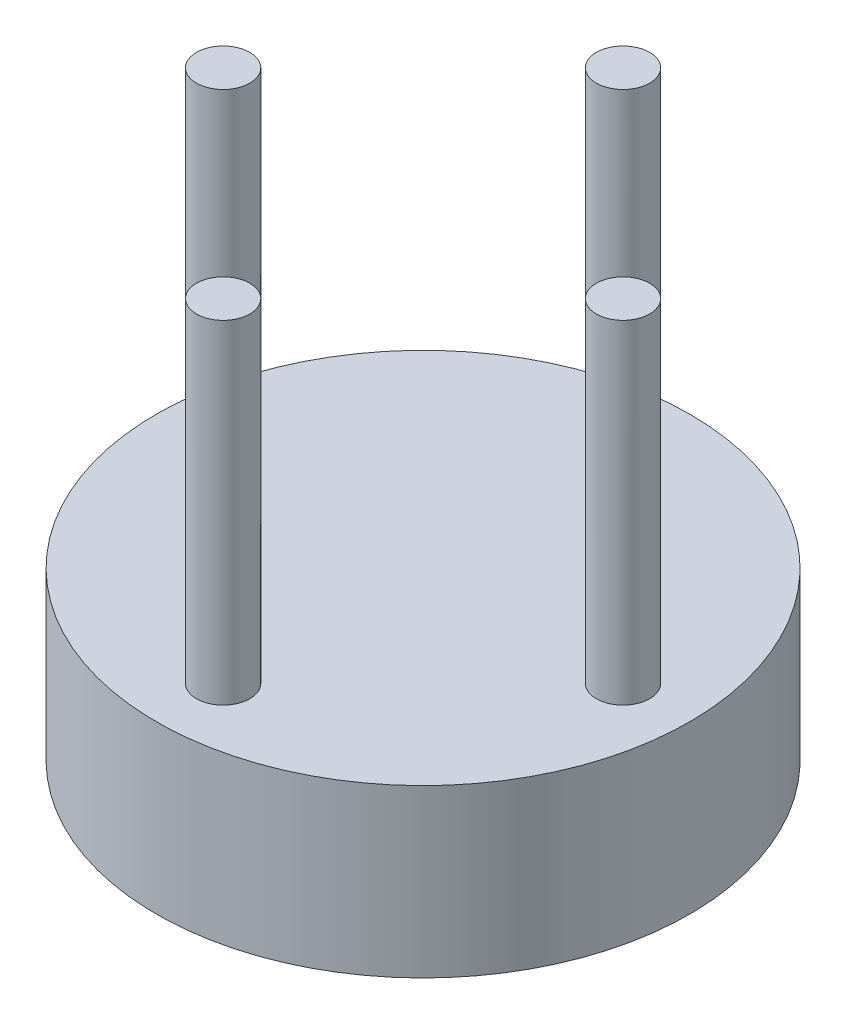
ISO-10303-21;
HEADER;
FILE_DESCRIPTION(('STEP AP214'),'2;1');
FILE_NAME('part.step','',(''),(''),'','','');
FILE_SCHEMA(('AUTOMOTIVE_DESIGN { 1 0 10303 214 1 1 1 1 }'));
ENDSEC;
DATA;
#1=APPLICATION_CONTEXT('core data for automotive mechanical design processes');
#2=APPLICATION_PROTOCOL_DEFINITION('international standard','automotive_design',2000,#1);
#3=PRODUCT_CONTEXT('',#1,'mechanical');
#4=PRODUCT('Part','Part','',(#3));
#5=PRODUCT_RELATED_PRODUCT_CATEGORY('part','',(#4));
#6=PRODUCT_DEFINITION_FORMATION('','',#4);
#7=PRODUCT_DEFINITION_CONTEXT('part definition',#1,'design');
#8=PRODUCT_DEFINITION('design','',#6,#7);
#9=PRODUCT_DEFINITION_SHAPE('','',#8);
#10=(LENGTH_UNIT() NAMED_UNIT(*) SI_UNIT(.MILLI.,.METRE.));
#11=(NAMED_UNIT(*) PLANE_ANGLE_UNIT() SI_UNIT($,.RADIAN.));
#12=(NAMED_UNIT(*) SI_UNIT($,.STERADIAN.) SOLID_ANGLE_UNIT());
#13=UNCERTAINTY_MEASURE_WITH_UNIT(LENGTH_MEASURE(1.E-05),#10,'distance_accuracy_value','');
#14=(GEOMETRIC_REPRESENTATION_CONTEXT(3) GLOBAL_UNCERTAINTY_ASSIGNED_CONTEXT((#13)) GLOBAL_UNIT_ASSIGNED_CONTEXT((#10,
#11,#12)) REPRESENTATION_CONTEXT('',''));
#15=CARTESIAN_POINT('',(0.,0.,0.));
#16=DIRECTION('',(0.,0.,1.));
#17=DIRECTION('',(1.,0.,0.));
#18=AXIS2_PLACEMENT_3D('',#15,#16,#17);
#19=CARTESIAN_POINT('',(-40.,30.,0.));
#20=DIRECTION('',(0.,-1.,0.));
#21=DIRECTION('',(0.,0.,-1.));
#22=AXIS2_PLACEMENT_3D('',#19,#20,#21);
#23=PLANE('',#22);
#24=CARTESIAN_POINT('',(-30.,30.,2.09489001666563E-13));
#25=DIRECTION('',(0.,-1.,0.));
#26=DIRECTION('',(0.,0.,-1.));
#27=AXIS2_PLACEMENT_3D('',#24,#25,#26);
#28=CIRCLE('',#27,4.);
#29=CARTESIAN_POINT('',(-30.,30.,-3.99999999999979));
#30=VERTEX_POINT('',#29);
#31=EDGE_CURVE('E29',#30,#30,#28,.F.);
#32=ORIENTED_EDGE('',*,*,#31,.F.);
#33=EDGE_LOOP('',(#32));
#34=FACE_BOUND('',#33,.T.);
#35=CARTESIAN_POINT('',(30.,30.,0.));
#36=DIRECTION('',(0.,-1.,0.));
#37=DIRECTION('',(0.,0.,-1.));
#38=AXIS2_PLACEMENT_3D('',#35,#36,#37);
#39=CIRCLE('',#38,4.);
#40=CARTESIAN_POINT('',(30.,30.,-4.));
#41=VERTEX_POINT('',#40);
#42=EDGE_CURVE('E37',#41,#41,#39,.F.);
#43=ORIENTED_EDGE('',*,*,#42,.F.);
#44=EDGE_LOOP('',(#43));
#45=FACE_BOUND('',#44,.T.);
#46=CARTESIAN_POINT('',(0.,30.,0.));
#47=DIRECTION('',(0.,-1.,0.));
#48=DIRECTION('',(0.,0.,-1.));
#49=AXIS2_PLACEMENT_3D('',#46,#47,#48);
#50=CIRCLE('',#49,40.);
#51=CARTESIAN_POINT('',(0.,30.,-40.));
#52=VERTEX_POINT('',#51);
#53=EDGE_CURVE('E57',#52,#52,#50,.T.);
#54=ORIENTED_EDGE('',*,*,#53,.F.);
#55=EDGE_LOOP('',(#54));
#56=FACE_BOUND('',#55,.T.);
#57=CARTESIAN_POINT('',(-1.04744500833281E-13,30.,-30.));
#58=DIRECTION('',(0.,-1.,0.));
#59=DIRECTION('',(0.,0.,-1.));
#60=AXIS2_PLACEMENT_3D('',#57,#58,#59);
#61=CIRCLE('',#60,4.);
#62=CARTESIAN_POINT('',(-1.04744500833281E-13,30.,-34.));
#63=VERTEX_POINT('',#62);
#64=EDGE_CURVE('E33',#63,#63,#61,.F.);
#65=ORIENTED_EDGE('',*,*,#64,.F.);
#66=EDGE_LOOP('',(#65));
#67=FACE_BOUND('',#66,.T.);
#68=CARTESIAN_POINT('',(3.14233502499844E-13,30.,30.));
#69=DIRECTION('',(0.,-1.,0.));
#70=DIRECTION('',(0.,0.,-1.));
#71=AXIS2_PLACEMENT_3D('',#68,#69,#70);
#72=CIRCLE('',#71,4.);
#73=CARTESIAN_POINT('',(3.14233502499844E-13,30.,26.));
#74=VERTEX_POINT('',#73);
#75=EDGE_CURVE('E10',#74,#74,#72,.F.);
#76=ORIENTED_EDGE('',*,*,#75,.F.);
#77=EDGE_LOOP('',(#76));
#78=FACE_BOUND('',#77,.T.);
#79=ADVANCED_FACE('F22',(#34,#45,#56,#67,#78),#23,.F.);
#80=CARTESIAN_POINT('',(0.,5.,0.));
#81=DIRECTION('',(0.,1.,0.));
#82=DIRECTION('',(0.,0.,1.));
#83=AXIS2_PLACEMENT_3D('',#80,#81,#82);
#84=PLANE('',#83);
#85=CARTESIAN_POINT('',(0.,5.,0.));
#86=DIRECTION('',(0.,-1.,0.));
#87=DIRECTION('',(0.,0.,-1.));
#88=AXIS2_PLACEMENT_3D('',#85,#86,#87);
#89=CIRCLE('',#88,27.5);
#90=CARTESIAN_POINT('',(0.,5.,-27.5));
#91=VERTEX_POINT('',#90);
#92=EDGE_CURVE('E42',#91,#91,#89,.T.);
#93=ORIENTED_EDGE('',*,*,#92,.T.);
#94=EDGE_LOOP('',(#93));
#95=FACE_BOUND('',#94,.T.);
#96=ADVANCED_FACE('F24',(#95),#84,.F.);
#97=CARTESIAN_POINT('',(0.,0.,0.));
#98=DIRECTION('',(0.,-1.,0.));
#99=DIRECTION('',(0.,0.,-1.));
#100=AXIS2_PLACEMENT_3D('',#97,#98,#99);
#101=CYLINDRICAL_SURFACE('',#100,27.5);
#102=ORIENTED_EDGE('',*,*,#92,.F.);
#103=EDGE_LOOP('',(#102));
#104=FACE_BOUND('',#103,.T.);
#105=CARTESIAN_POINT('',(0.,0.,0.));
#106=DIRECTION('',(0.,-1.,0.));
#107=DIRECTION('',(0.,0.,-1.));
#108=AXIS2_PLACEMENT_3D('',#105,#106,#107);
#109=CIRCLE('',#108,27.5);
#110=CARTESIAN_POINT('',(0.,0.,-27.5));
#111=VERTEX_POINT('',#110);
#112=EDGE_CURVE('E45',#111,#111,#109,.T.);
#113=ORIENTED_EDGE('',*,*,#112,.T.);
#114=EDGE_LOOP('',(#113));
#115=FACE_BOUND('',#114,.T.);
#116=ADVANCED_FACE('F93',(#104,#115),#101,.F.);
#117=CARTESIAN_POINT('',(-27.5,0.,0.));
#118=DIRECTION('',(0.,1.,0.));
#119=DIRECTION('',(0.,0.,1.));
#120=AXIS2_PLACEMENT_3D('',#117,#118,#119);
#121=PLANE('',#120);
#122=ORIENTED_EDGE('',*,*,#112,.F.);
#123=EDGE_LOOP('',(#122));
#124=FACE_BOUND('',#123,.T.);
#125=CARTESIAN_POINT('',(0.,0.,0.));
#126=DIRECTION('',(0.,-1.,0.));
#127=DIRECTION('',(0.,0.,-1.));
#128=AXIS2_PLACEMENT_3D('',#125,#126,#127);
#129=CIRCLE('',#128,32.5);
#130=CARTESIAN_POINT('',(0.,0.,-32.5));
#131=VERTEX_POINT('',#130);
#132=EDGE_CURVE('E48',#131,#131,#129,.T.);
#133=ORIENTED_EDGE('',*,*,#132,.T.);
#134=EDGE_LOOP('',(#133));
#135=FACE_BOUND('',#134,.T.);
#136=ADVANCED_FACE('F111',(#124,#135),#121,.F.);
#137=CARTESIAN_POINT('',(0.,0.,0.));
#138=DIRECTION('',(0.,-1.,0.));
#139=DIRECTION('',(0.,0.,-1.));
#140=AXIS2_PLACEMENT_3D('',#137,#138,#139);
#141=CYLINDRICAL_SURFACE('',#140,32.5);
#142=ORIENTED_EDGE('',*,*,#132,.F.);
#143=EDGE_LOOP('',(#142));
#144=FACE_BOUND('',#143,.T.);
#145=CARTESIAN_POINT('',(0.,5.,0.));
#146=DIRECTION('',(0.,-1.,0.));
#147=DIRECTION('',(0.,0.,-1.));
#148=AXIS2_PLACEMENT_3D('',#145,#146,#147);
#149=CIRCLE('',#148,32.5);
#150=CARTESIAN_POINT('',(0.,5.,-32.5));
#151=VERTEX_POINT('',#150);
#152=EDGE_CURVE('E51',#151,#151,#149,.T.);
#153=ORIENTED_EDGE('',*,*,#152,.T.);
#154=EDGE_LOOP('',(#153));
#155=FACE_BOUND('',#154,.T.);
#156=ADVANCED_FACE('F107',(#144,#155),#141,.T.);
#157=CARTESIAN_POINT('',(-32.5,5.,0.));
#158=DIRECTION('',(0.,1.,0.));
#159=DIRECTION('',(0.,0.,1.));
#160=AXIS2_PLACEMENT_3D('',#157,#158,#159);
#161=PLANE('',#160);
#162=ORIENTED_EDGE('',*,*,#152,.F.);
#163=EDGE_LOOP('',(#162));
#164=FACE_BOUND('',#163,.T.);
#165=CARTESIAN_POINT('',(0.,5.,0.));
#166=DIRECTION('',(0.,-1.,0.));
#167=DIRECTION('',(0.,0.,-1.));
#168=AXIS2_PLACEMENT_3D('',#165,#166,#167);
#169=CIRCLE('',#168,40.);
#170=CARTESIAN_POINT('',(0.,5.,-40.));
#171=VERTEX_POINT('',#170);
#172=EDGE_CURVE('E54',#171,#171,#169,.T.);
#173=ORIENTED_EDGE('',*,*,#172,.T.);
#174=EDGE_LOOP('',(#173));
#175=FACE_BOUND('',#174,.T.);
#176=ADVANCED_FACE('F103',(#164,#175),#161,.F.);
#177=CARTESIAN_POINT('',(0.,0.,0.));
#178=DIRECTION('',(0.,-1.,0.));
#179=DIRECTION('',(0.,0.,-1.));
#180=AXIS2_PLACEMENT_3D('',#177,#178,#179);
#181=CYLINDRICAL_SURFACE('',#180,40.);
#182=ORIENTED_EDGE('',*,*,#172,.F.);
#183=EDGE_LOOP('',(#182));
#184=FACE_BOUND('',#183,.T.);
#185=ORIENTED_EDGE('',*,*,#53,.T.);
#186=EDGE_LOOP('',(#185));
#187=FACE_BOUND('',#186,.T.);
#188=ADVANCED_FACE('F100',(#184,#187),#181,.T.);
#189=CARTESIAN_POINT('',(30.,80.,0.));
#190=DIRECTION('',(0.,-1.,0.));
#191=DIRECTION('',(0.,0.,-1.));
#192=AXIS2_PLACEMENT_3D('',#189,#190,#191);
#193=CYLINDRICAL_SURFACE('',#192,4.);
#194=CARTESIAN_POINT('',(30.,80.,0.));
#195=DIRECTION('',(0.,1.,0.));
#196=DIRECTION('',(0.,0.,1.));
#197=AXIS2_PLACEMENT_3D('',#194,#195,#196);
#198=CIRCLE('',#197,4.);
#199=CARTESIAN_POINT('',(30.,80.,4.));
#200=VERTEX_POINT('',#199);
#201=EDGE_CURVE('E60',#200,#200,#198,.T.);
#202=ORIENTED_EDGE('',*,*,#201,.F.);
#203=EDGE_LOOP('',(#202));
#204=FACE_BOUND('',#203,.T.);
#205=ORIENTED_EDGE('',*,*,#42,.T.);
#206=EDGE_LOOP('',(#205));
#207=FACE_BOUND('',#206,.T.);
#208=ADVANCED_FACE('F98',(#204,#207),#193,.T.);
#209=CARTESIAN_POINT('',(30.,80.,0.));
#210=DIRECTION('',(0.,1.,0.));
#211=DIRECTION('',(0.,0.,1.));
#212=AXIS2_PLACEMENT_3D('',#209,#210,#211);
#213=PLANE('',#212);
#214=ORIENTED_EDGE('',*,*,#201,.T.);
#215=EDGE_LOOP('',(#214));
#216=FACE_BOUND('',#215,.T.);
#217=ADVANCED_FACE('F138',(#216),#213,.T.);
#218=CARTESIAN_POINT('',(-1.04744500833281E-13,80.,-30.));
#219=DIRECTION('',(0.,-1.,0.));
#220=DIRECTION('',(0.,0.,-1.));
#221=AXIS2_PLACEMENT_3D('',#218,#219,#220);
#222=CYLINDRICAL_SURFACE('',#221,4.);
#223=CARTESIAN_POINT('',(-1.04744500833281E-13,80.,-30.));
#224=DIRECTION('',(0.,1.,0.));
#225=DIRECTION('',(1.,0.,0.));
#226=AXIS2_PLACEMENT_3D('',#223,#224,#225);
#227=CIRCLE('',#226,4.);
#228=CARTESIAN_POINT('',(3.99999999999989,80.,-30.));
#229=VERTEX_POINT('',#228);
#230=EDGE_CURVE('E63',#229,#229,#227,.T.);
#231=ORIENTED_EDGE('',*,*,#230,.F.);
#232=EDGE_LOOP('',(#231));
#233=FACE_BOUND('',#232,.T.);
#234=ORIENTED_EDGE('',*,*,#64,.T.);
#235=EDGE_LOOP('',(#234));
#236=FACE_BOUND('',#235,.T.);
#237=ADVANCED_FACE('F135',(#233,#236),#222,.T.);
#238=CARTESIAN_POINT('',(-1.04744500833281E-13,80.,-30.));
#239=DIRECTION('',(0.,1.,0.));
#240=DIRECTION('',(1.,0.,0.));
#241=AXIS2_PLACEMENT_3D('',#238,#239,#240);
#242=PLANE('',#241);
#243=ORIENTED_EDGE('',*,*,#230,.T.);
#244=EDGE_LOOP('',(#243));
#245=FACE_BOUND('',#244,.T.);
#246=ADVANCED_FACE('F137',(#245),#242,.T.);
#247=CARTESIAN_POINT('',(-30.,80.,2.09489001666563E-13));
#248=DIRECTION('',(0.,-1.,0.));
#249=DIRECTION('',(0.,0.,-1.));
#250=AXIS2_PLACEMENT_3D('',#247,#248,#249);
#251=CYLINDRICAL_SURFACE('',#250,4.);
#252=CARTESIAN_POINT('',(-30.,80.,2.09489001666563E-13));
#253=DIRECTION('',(0.,1.,0.));
#254=DIRECTION('',(0.,0.,-1.));
#255=AXIS2_PLACEMENT_3D('',#252,#253,#254);
#256=CIRCLE('',#255,4.);
#257=CARTESIAN_POINT('',(-30.,80.,-3.99999999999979));
#258=VERTEX_POINT('',#257);
#259=EDGE_CURVE('E66',#258,#258,#256,.T.);
#260=ORIENTED_EDGE('',*,*,#259,.F.);
#261=EDGE_LOOP('',(#260));
#262=FACE_BOUND('',#261,.T.);
#263=ORIENTED_EDGE('',*,*,#31,.T.);
#264=EDGE_LOOP('',(#263));
#265=FACE_BOUND('',#264,.T.);
#266=ADVANCED_FACE('F84',(#262,#265),#251,.T.);
#267=CARTESIAN_POINT('',(-30.,80.,2.09489001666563E-13));
#268=DIRECTION('',(0.,1.,0.));
#269=DIRECTION('',(0.,0.,-1.));
#270=AXIS2_PLACEMENT_3D('',#267,#268,#269);
#271=PLANE('',#270);
#272=ORIENTED_EDGE('',*,*,#259,.T.);
#273=EDGE_LOOP('',(#272));
#274=FACE_BOUND('',#273,.T.);
#275=ADVANCED_FACE('F77',(#274),#271,.T.);
#276=CARTESIAN_POINT('',(3.14233502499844E-13,80.,30.));
#277=DIRECTION('',(0.,-1.,0.));
#278=DIRECTION('',(0.,0.,-1.));
#279=AXIS2_PLACEMENT_3D('',#276,#277,#278);
#280=CYLINDRICAL_SURFACE('',#279,4.);
#281=CARTESIAN_POINT('',(3.14233502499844E-13,80.,30.));
#282=DIRECTION('',(0.,1.,0.));
#283=DIRECTION('',(-1.,0.,0.));
#284=AXIS2_PLACEMENT_3D('',#281,#282,#283);
#285=CIRCLE('',#284,4.);
#286=CARTESIAN_POINT('',(-3.99999999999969,80.,30.));
#287=VERTEX_POINT('',#286);
#288=EDGE_CURVE('E69',#287,#287,#285,.T.);
#289=ORIENTED_EDGE('',*,*,#288,.F.);
#290=EDGE_LOOP('',(#289));
#291=FACE_BOUND('',#290,.T.);
#292=ORIENTED_EDGE('',*,*,#75,.T.);
#293=EDGE_LOOP('',(#292));
#294=FACE_BOUND('',#293,.T.);
#295=ADVANCED_FACE('F75',(#291,#294),#280,.T.);
#296=CARTESIAN_POINT('',(3.14233502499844E-13,80.,30.));
#297=DIRECTION('',(0.,1.,0.));
#298=DIRECTION('',(-1.,0.,0.));
#299=AXIS2_PLACEMENT_3D('',#296,#297,#298);
#300=PLANE('',#299);
#301=ORIENTED_EDGE('',*,*,#288,.T.);
#302=EDGE_LOOP('',(#301));
#303=FACE_BOUND('',#302,.T.);
#304=ADVANCED_FACE('F73',(#303),#300,.T.);
#305=CLOSED_SHELL('',(#79,#96,#116,#136,#156,#176,#188,#208,#217,#237,#246,#266,#275,#295,#304));
#306=MANIFOLD_SOLID_BREP('B2',#305);
#307=ADVANCED_BREP_SHAPE_REPRESENTATION('',(#18,#306),#14);
#308=SHAPE_DEFINITION_REPRESENTATION(#9,#307);
ENDSEC;
END-ISO-10303-21;
